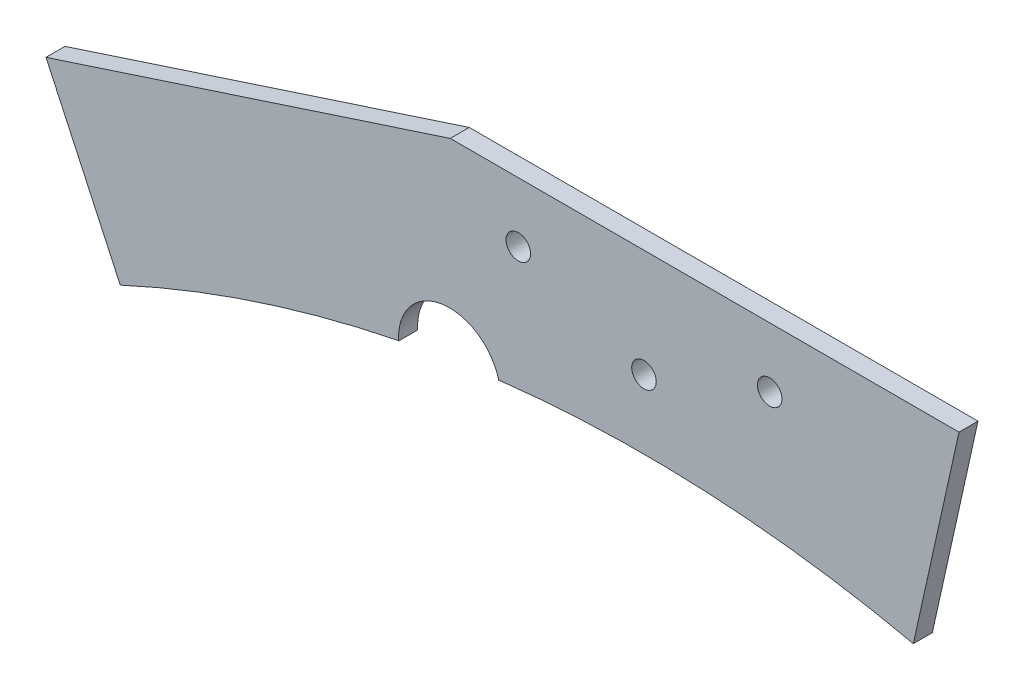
ISO-10303-21;
HEADER;
FILE_DESCRIPTION(('STEP AP214'),'2;1');
FILE_NAME('part.step','',(''),(''),'','','');
FILE_SCHEMA(('AUTOMOTIVE_DESIGN { 1 0 10303 214 1 1 1 1 }'));
ENDSEC;
DATA;
#1=APPLICATION_CONTEXT('core data for automotive mechanical design processes');
#2=APPLICATION_PROTOCOL_DEFINITION('international standard','automotive_design',2000,#1);
#3=PRODUCT_CONTEXT('',#1,'mechanical');
#4=PRODUCT('Part','Part','',(#3));
#5=PRODUCT_RELATED_PRODUCT_CATEGORY('part','',(#4));
#6=PRODUCT_DEFINITION_FORMATION('','',#4);
#7=PRODUCT_DEFINITION_CONTEXT('part definition',#1,'design');
#8=PRODUCT_DEFINITION('design','',#6,#7);
#9=PRODUCT_DEFINITION_SHAPE('','',#8);
#10=(LENGTH_UNIT() NAMED_UNIT(*) SI_UNIT(.MILLI.,.METRE.));
#11=(NAMED_UNIT(*) PLANE_ANGLE_UNIT() SI_UNIT($,.RADIAN.));
#12=(NAMED_UNIT(*) SI_UNIT($,.STERADIAN.) SOLID_ANGLE_UNIT());
#13=UNCERTAINTY_MEASURE_WITH_UNIT(LENGTH_MEASURE(1.E-05),#10,'distance_accuracy_value','');
#14=(GEOMETRIC_REPRESENTATION_CONTEXT(3) GLOBAL_UNCERTAINTY_ASSIGNED_CONTEXT((#13)) GLOBAL_UNIT_ASSIGNED_CONTEXT((#10,
#11,#12)) REPRESENTATION_CONTEXT('',''));
#15=CARTESIAN_POINT('',(0.,0.,0.));
#16=DIRECTION('',(0.,0.,1.));
#17=DIRECTION('',(1.,0.,0.));
#18=AXIS2_PLACEMENT_3D('',#15,#16,#17);
#19=CARTESIAN_POINT('',(0.,0.,6.35));
#20=DIRECTION('',(0.,0.,-1.));
#21=DIRECTION('',(-1.,0.,0.));
#22=AXIS2_PLACEMENT_3D('',#19,#20,#21);
#23=CYLINDRICAL_SURFACE('',#22,416.);
#24=DIRECTION('',(0.,0.,-1.));
#25=VECTOR('',#24,1.);
#26=CARTESIAN_POINT('',(-48.4733196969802,413.166234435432,6.46192739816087));
#27=LINE('',#26,#25);
#28=CARTESIAN_POINT('',(-48.4733196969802,413.166234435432,6.35));
#29=VERTEX_POINT('',#28);
#30=CARTESIAN_POINT('',(-48.4733196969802,413.166234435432,0.));
#31=VERTEX_POINT('',#30);
#32=EDGE_CURVE('E103',#29,#31,#27,.T.);
#33=ORIENTED_EDGE('',*,*,#32,.T.);
#34=CARTESIAN_POINT('',(0.,0.,0.));
#35=DIRECTION('',(0.,0.,-1.));
#36=DIRECTION('',(1.,0.,0.));
#37=AXIS2_PLACEMENT_3D('',#34,#35,#36);
#38=CIRCLE('',#37,416.);
#39=CARTESIAN_POINT('',(89.9999999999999,406.147756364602,0.));
#40=VERTEX_POINT('',#39);
#41=EDGE_CURVE('E145',#31,#40,#38,.T.);
#42=ORIENTED_EDGE('',*,*,#41,.T.);
#43=DIRECTION('',(0.,0.,-1.));
#44=VECTOR('',#43,1.);
#45=CARTESIAN_POINT('',(89.9999999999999,406.147756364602,6.35));
#46=LINE('',#45,#44);
#47=CARTESIAN_POINT('',(89.9999999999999,406.147756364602,6.35));
#48=VERTEX_POINT('',#47);
#49=EDGE_CURVE('E40',#48,#40,#46,.T.);
#50=ORIENTED_EDGE('',*,*,#49,.F.);
#51=CARTESIAN_POINT('',(0.,0.,6.35));
#52=DIRECTION('',(0.,0.,-1.));
#53=DIRECTION('',(1.,0.,0.));
#54=AXIS2_PLACEMENT_3D('',#51,#52,#53);
#55=CIRCLE('',#54,416.);
#56=EDGE_CURVE('E118',#29,#48,#55,.T.);
#57=ORIENTED_EDGE('',*,*,#56,.F.);
#58=EDGE_LOOP('',(#33,#42,#50,#57));
#59=FACE_BOUND('',#58,.T.);
#60=ADVANCED_FACE('F32',(#59),#23,.F.);
#61=DIRECTION('',(0.,0.,-1.));
#62=VECTOR('',#61,1.);
#63=CARTESIAN_POINT('',(-82.0456201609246,407.829028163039,6.46192739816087));
#64=LINE('',#63,#62);
#65=CARTESIAN_POINT('',(-82.0456201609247,407.829028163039,6.35));
#66=VERTEX_POINT('',#65);
#67=CARTESIAN_POINT('',(-82.0456201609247,407.829028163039,0.));
#68=VERTEX_POINT('',#67);
#69=EDGE_CURVE('E47',#66,#68,#64,.T.);
#70=ORIENTED_EDGE('',*,*,#69,.F.);
#71=CARTESIAN_POINT('',(-175.,377.40031796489,6.35));
#72=VERTEX_POINT('',#71);
#73=EDGE_CURVE('E126',#72,#66,#55,.T.);
#74=ORIENTED_EDGE('',*,*,#73,.F.);
#75=DIRECTION('',(0.,0.,-1.));
#76=VECTOR('',#75,1.);
#77=CARTESIAN_POINT('',(-175.,377.40031796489,6.35));
#78=LINE('',#77,#76);
#79=CARTESIAN_POINT('',(-175.,377.40031796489,0.));
#80=VERTEX_POINT('',#79);
#81=EDGE_CURVE('E142',#72,#80,#78,.T.);
#82=ORIENTED_EDGE('',*,*,#81,.T.);
#83=EDGE_CURVE('E52',#80,#68,#38,.T.);
#84=ORIENTED_EDGE('',*,*,#83,.T.);
#85=EDGE_LOOP('',(#70,#74,#82,#84));
#86=FACE_BOUND('',#85,.T.);
#87=ADVANCED_FACE('F34',(#86),#23,.F.);
#88=CARTESIAN_POINT('',(-220.25683615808,475.,6.35));
#89=DIRECTION('',(0.,-1.,0.));
#90=DIRECTION('',(0.,0.,-1.));
#91=AXIS2_PLACEMENT_3D('',#88,#89,#90);
#92=PLANE('',#91);
#93=DIRECTION('',(0.,0.,-1.));
#94=VECTOR('',#93,1.);
#95=CARTESIAN_POINT('',(-64.7427399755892,475.,439.150432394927));
#96=LINE('',#95,#94);
#97=CARTESIAN_POINT('',(-64.742739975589,475.,6.35));
#98=VERTEX_POINT('',#97);
#99=CARTESIAN_POINT('',(-64.742739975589,475.,0.));
#100=VERTEX_POINT('',#99);
#101=EDGE_CURVE('E165',#98,#100,#96,.T.);
#102=ORIENTED_EDGE('',*,*,#101,.F.);
#103=DIRECTION('',(-1.,0.,0.));
#104=VECTOR('',#103,1.);
#105=CARTESIAN_POINT('',(-220.25683615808,475.,6.35));
#106=LINE('',#105,#104);
#107=CARTESIAN_POINT('',(105.257260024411,475.,6.35));
#108=VERTEX_POINT('',#107);
#109=EDGE_CURVE('E137',#108,#98,#106,.T.);
#110=ORIENTED_EDGE('',*,*,#109,.F.);
#111=DIRECTION('',(0.,0.,-1.));
#112=VECTOR('',#111,1.);
#113=CARTESIAN_POINT('',(105.257260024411,475.,6.35));
#114=LINE('',#113,#112);
#115=CARTESIAN_POINT('',(105.257260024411,475.,0.));
#116=VERTEX_POINT('',#115);
#117=EDGE_CURVE('E150',#108,#116,#114,.T.);
#118=ORIENTED_EDGE('',*,*,#117,.T.);
#119=DIRECTION('',(-1.,0.,0.));
#120=VECTOR('',#119,1.);
#121=CARTESIAN_POINT('',(-220.25683615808,475.,0.));
#122=LINE('',#121,#120);
#123=EDGE_CURVE('E130',#116,#100,#122,.T.);
#124=ORIENTED_EDGE('',*,*,#123,.T.);
#125=EDGE_LOOP('',(#102,#110,#118,#124));
#126=FACE_BOUND('',#125,.T.);
#127=ADVANCED_FACE('F218',(#126),#92,.F.);
#128=CARTESIAN_POINT('',(-175.,377.40031796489,6.35));
#129=DIRECTION('',(0.907212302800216,0.420673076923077,0.));
#130=DIRECTION('',(-0.420673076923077,0.907212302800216,0.));
#131=AXIS2_PLACEMENT_3D('',#128,#129,#130);
#132=PLANE('',#131);
#133=DIRECTION('',(0.,0.,-1.));
#134=VECTOR('',#133,1.);
#135=CARTESIAN_POINT('',(-199.819711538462,430.925843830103,439.150432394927));
#136=LINE('',#135,#134);
#137=CARTESIAN_POINT('',(-199.819711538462,430.925843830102,6.35));
#138=VERTEX_POINT('',#137);
#139=CARTESIAN_POINT('',(-199.819711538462,430.925843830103,0.));
#140=VERTEX_POINT('',#139);
#141=EDGE_CURVE('E167',#138,#140,#136,.T.);
#142=ORIENTED_EDGE('',*,*,#141,.T.);
#143=DIRECTION('',(0.420673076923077,-0.907212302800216,0.));
#144=VECTOR('',#143,1.);
#145=CARTESIAN_POINT('',(-175.,377.40031796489,0.));
#146=LINE('',#145,#144);
#147=EDGE_CURVE('E127',#140,#80,#146,.T.);
#148=ORIENTED_EDGE('',*,*,#147,.T.);
#149=ORIENTED_EDGE('',*,*,#81,.F.);
#150=DIRECTION('',(0.420673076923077,-0.907212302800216,0.));
#151=VECTOR('',#150,1.);
#152=CARTESIAN_POINT('',(-175.,377.40031796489,6.35));
#153=LINE('',#152,#151);
#154=EDGE_CURVE('E140',#138,#72,#153,.T.);
#155=ORIENTED_EDGE('',*,*,#154,.F.);
#156=EDGE_LOOP('',(#142,#148,#149,#155));
#157=FACE_BOUND('',#156,.T.);
#158=ADVANCED_FACE('F194',(#157),#132,.F.);
#159=CARTESIAN_POINT('',(0.,0.,6.35));
#160=DIRECTION('',(0.,0.,1.));
#161=DIRECTION('',(1.,0.,0.));
#162=AXIS2_PLACEMENT_3D('',#159,#160,#161);
#163=PLANE('',#162);
#164=CARTESIAN_POINT('',(-64.9999999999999,408.865503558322,6.35));
#165=DIRECTION('',(0.,0.,1.));
#166=DIRECTION('',(1.,0.,0.));
#167=AXIS2_PLACEMENT_3D('',#164,#165,#166);
#168=CIRCLE('',#167,17.);
#169=CARTESIAN_POINT('',(-48.532051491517,413.085298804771,6.35));
#170=VERTEX_POINT('',#169);
#171=CARTESIAN_POINT('',(-81.9646845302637,407.770296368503,6.35));
#172=VERTEX_POINT('',#171);
#173=EDGE_CURVE('E121',#170,#172,#168,.T.);
#174=ORIENTED_EDGE('',*,*,#173,.F.);
#175=DIRECTION('',(0.587317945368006,0.809356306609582,0.));
#176=VECTOR('',#175,1.);
#177=CARTESIAN_POINT('',(-48.532051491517,413.085298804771,6.35));
#178=LINE('',#177,#176);
#179=EDGE_CURVE('E107',#170,#29,#178,.T.);
#180=ORIENTED_EDGE('',*,*,#179,.T.);
#181=ORIENTED_EDGE('',*,*,#56,.T.);
#182=DIRECTION('',(0.216346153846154,0.976316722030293,0.));
#183=VECTOR('',#182,1.);
#184=CARTESIAN_POINT('',(89.9999999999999,406.147756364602,6.35));
#185=LINE('',#184,#183);
#186=EDGE_CURVE('E129',#48,#108,#185,.T.);
#187=ORIENTED_EDGE('',*,*,#186,.T.);
#188=ORIENTED_EDGE('',*,*,#109,.T.);
#189=DIRECTION('',(-0.950673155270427,-0.310194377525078,0.));
#190=VECTOR('',#189,1.);
#191=CARTESIAN_POINT('',(-146.303979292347,448.387448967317,6.35));
#192=LINE('',#191,#190);
#193=EDGE_CURVE('E158',#98,#138,#192,.T.);
#194=ORIENTED_EDGE('',*,*,#193,.T.);
#195=ORIENTED_EDGE('',*,*,#154,.T.);
#196=ORIENTED_EDGE('',*,*,#73,.T.);
#197=DIRECTION('',(0.809356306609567,-0.587317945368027,0.));
#198=VECTOR('',#197,1.);
#199=CARTESIAN_POINT('',(-81.9646845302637,407.770296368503,6.35));
#200=LINE('',#199,#198);
#201=EDGE_CURVE('E248',#66,#172,#200,.T.);
#202=ORIENTED_EDGE('',*,*,#201,.T.);
#203=EDGE_LOOP('',(#174,#180,#181,#187,#188,#194,#195,#196,#202));
#204=FACE_BOUND('',#203,.T.);
#205=CARTESIAN_POINT('',(0.,439.,6.35));
#206=DIRECTION('',(0.,0.,1.));
#207=DIRECTION('',(1.,0.,0.));
#208=AXIS2_PLACEMENT_3D('',#205,#206,#207);
#209=CIRCLE('',#208,4.09999999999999);
#210=CARTESIAN_POINT('',(4.09999999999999,439.,6.35));
#211=VERTEX_POINT('',#210);
#212=EDGE_CURVE('E134',#211,#211,#209,.T.);
#213=ORIENTED_EDGE('',*,*,#212,.F.);
#214=EDGE_LOOP('',(#213));
#215=FACE_BOUND('',#214,.T.);
#216=CARTESIAN_POINT('',(42.,455.,6.35));
#217=DIRECTION('',(0.,0.,1.));
#218=DIRECTION('',(1.,0.,0.));
#219=AXIS2_PLACEMENT_3D('',#216,#217,#218);
#220=CIRCLE('',#219,4.1);
#221=CARTESIAN_POINT('',(46.1,455.,6.35));
#222=VERTEX_POINT('',#221);
#223=EDGE_CURVE('E177',#222,#222,#220,.T.);
#224=ORIENTED_EDGE('',*,*,#223,.F.);
#225=EDGE_LOOP('',(#224));
#226=FACE_BOUND('',#225,.T.);
#227=CARTESIAN_POINT('',(-42.,455.,6.35));
#228=DIRECTION('',(0.,0.,1.));
#229=DIRECTION('',(1.,0.,0.));
#230=AXIS2_PLACEMENT_3D('',#227,#228,#229);
#231=CIRCLE('',#230,4.1);
#232=CARTESIAN_POINT('',(-37.9,455.,6.35));
#233=VERTEX_POINT('',#232);
#234=EDGE_CURVE('E168',#233,#233,#231,.T.);
#235=ORIENTED_EDGE('',*,*,#234,.F.);
#236=EDGE_LOOP('',(#235));
#237=FACE_BOUND('',#236,.T.);
#238=ADVANCED_FACE('F116',(#204,#215,#226,#237),#163,.T.);
#239=CARTESIAN_POINT('',(0.,0.,0.));
#240=DIRECTION('',(0.,0.,1.));
#241=DIRECTION('',(1.,0.,0.));
#242=AXIS2_PLACEMENT_3D('',#239,#240,#241);
#243=PLANE('',#242);
#244=CARTESIAN_POINT('',(0.,439.,0.));
#245=DIRECTION('',(0.,0.,1.));
#246=DIRECTION('',(1.,0.,0.));
#247=AXIS2_PLACEMENT_3D('',#244,#245,#246);
#248=CIRCLE('',#247,4.09999999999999);
#249=CARTESIAN_POINT('',(4.09999999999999,439.,0.));
#250=VERTEX_POINT('',#249);
#251=EDGE_CURVE('E183',#250,#250,#248,.T.);
#252=ORIENTED_EDGE('',*,*,#251,.T.);
#253=EDGE_LOOP('',(#252));
#254=FACE_BOUND('',#253,.T.);
#255=CARTESIAN_POINT('',(42.,455.,0.));
#256=DIRECTION('',(0.,0.,1.));
#257=DIRECTION('',(1.,0.,0.));
#258=AXIS2_PLACEMENT_3D('',#255,#256,#257);
#259=CIRCLE('',#258,4.1);
#260=CARTESIAN_POINT('',(46.1,455.,0.));
#261=VERTEX_POINT('',#260);
#262=EDGE_CURVE('E179',#261,#261,#259,.T.);
#263=ORIENTED_EDGE('',*,*,#262,.T.);
#264=EDGE_LOOP('',(#263));
#265=FACE_BOUND('',#264,.T.);
#266=CARTESIAN_POINT('',(-42.,455.,0.));
#267=DIRECTION('',(0.,0.,1.));
#268=DIRECTION('',(1.,0.,0.));
#269=AXIS2_PLACEMENT_3D('',#266,#267,#268);
#270=CIRCLE('',#269,4.1);
#271=CARTESIAN_POINT('',(-37.9,455.,0.));
#272=VERTEX_POINT('',#271);
#273=EDGE_CURVE('E171',#272,#272,#270,.T.);
#274=ORIENTED_EDGE('',*,*,#273,.T.);
#275=EDGE_LOOP('',(#274));
#276=FACE_BOUND('',#275,.T.);
#277=ORIENTED_EDGE('',*,*,#41,.F.);
#278=DIRECTION('',(0.587317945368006,0.809356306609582,0.));
#279=VECTOR('',#278,1.);
#280=CARTESIAN_POINT('',(-48.532051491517,413.085298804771,0.));
#281=LINE('',#280,#279);
#282=CARTESIAN_POINT('',(-48.532051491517,413.085298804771,0.));
#283=VERTEX_POINT('',#282);
#284=EDGE_CURVE('E110',#283,#31,#281,.T.);
#285=ORIENTED_EDGE('',*,*,#284,.F.);
#286=CARTESIAN_POINT('',(-64.9999999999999,408.865503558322,0.));
#287=DIRECTION('',(0.,0.,1.));
#288=DIRECTION('',(1.,0.,0.));
#289=AXIS2_PLACEMENT_3D('',#286,#287,#288);
#290=CIRCLE('',#289,17.);
#291=CARTESIAN_POINT('',(-81.9646845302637,407.770296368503,0.));
#292=VERTEX_POINT('',#291);
#293=EDGE_CURVE('E245',#283,#292,#290,.T.);
#294=ORIENTED_EDGE('',*,*,#293,.T.);
#295=DIRECTION('',(0.809356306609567,-0.587317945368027,0.));
#296=VECTOR('',#295,1.);
#297=CARTESIAN_POINT('',(-81.9646845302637,407.770296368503,0.));
#298=LINE('',#297,#296);
#299=EDGE_CURVE('E253',#68,#292,#298,.T.);
#300=ORIENTED_EDGE('',*,*,#299,.F.);
#301=ORIENTED_EDGE('',*,*,#83,.F.);
#302=ORIENTED_EDGE('',*,*,#147,.F.);
#303=DIRECTION('',(-0.950673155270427,-0.310194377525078,0.));
#304=VECTOR('',#303,1.);
#305=CARTESIAN_POINT('',(-146.303979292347,448.387448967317,0.));
#306=LINE('',#305,#304);
#307=EDGE_CURVE('E11',#100,#140,#306,.T.);
#308=ORIENTED_EDGE('',*,*,#307,.F.);
#309=ORIENTED_EDGE('',*,*,#123,.F.);
#310=DIRECTION('',(0.216346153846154,0.976316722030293,0.));
#311=VECTOR('',#310,1.);
#312=CARTESIAN_POINT('',(89.9999999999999,406.147756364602,0.));
#313=LINE('',#312,#311);
#314=EDGE_CURVE('E144',#40,#116,#313,.T.);
#315=ORIENTED_EDGE('',*,*,#314,.F.);
#316=EDGE_LOOP('',(#277,#285,#294,#300,#301,#302,#308,#309,#315));
#317=FACE_BOUND('',#316,.T.);
#318=ADVANCED_FACE('F193',(#254,#265,#276,#317),#243,.F.);
#319=CARTESIAN_POINT('',(89.9999999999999,406.147756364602,6.35));
#320=DIRECTION('',(-0.976316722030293,0.216346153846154,0.));
#321=DIRECTION('',(-0.216346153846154,-0.976316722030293,0.));
#322=AXIS2_PLACEMENT_3D('',#319,#320,#321);
#323=PLANE('',#322);
#324=ORIENTED_EDGE('',*,*,#314,.T.);
#325=ORIENTED_EDGE('',*,*,#117,.F.);
#326=ORIENTED_EDGE('',*,*,#186,.F.);
#327=ORIENTED_EDGE('',*,*,#49,.T.);
#328=EDGE_LOOP('',(#324,#325,#326,#327));
#329=FACE_BOUND('',#328,.T.);
#330=ADVANCED_FACE('F153',(#329),#323,.F.);
#331=CARTESIAN_POINT('',(0.,439.,0.));
#332=DIRECTION('',(0.,0.,1.));
#333=DIRECTION('',(1.,0.,0.));
#334=AXIS2_PLACEMENT_3D('',#331,#332,#333);
#335=CYLINDRICAL_SURFACE('',#334,4.09999999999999);
#336=ORIENTED_EDGE('',*,*,#251,.F.);
#337=EDGE_LOOP('',(#336));
#338=FACE_BOUND('',#337,.T.);
#339=ORIENTED_EDGE('',*,*,#212,.T.);
#340=EDGE_LOOP('',(#339));
#341=FACE_BOUND('',#340,.T.);
#342=ADVANCED_FACE('F190',(#338,#341),#335,.F.);
#343=CARTESIAN_POINT('',(42.,455.,0.));
#344=DIRECTION('',(0.,0.,1.));
#345=DIRECTION('',(1.,0.,0.));
#346=AXIS2_PLACEMENT_3D('',#343,#344,#345);
#347=CYLINDRICAL_SURFACE('',#346,4.1);
#348=ORIENTED_EDGE('',*,*,#262,.F.);
#349=EDGE_LOOP('',(#348));
#350=FACE_BOUND('',#349,.T.);
#351=ORIENTED_EDGE('',*,*,#223,.T.);
#352=EDGE_LOOP('',(#351));
#353=FACE_BOUND('',#352,.T.);
#354=ADVANCED_FACE('F202',(#350,#353),#347,.F.);
#355=CARTESIAN_POINT('',(-42.,455.,0.));
#356=DIRECTION('',(0.,0.,1.));
#357=DIRECTION('',(1.,0.,0.));
#358=AXIS2_PLACEMENT_3D('',#355,#356,#357);
#359=CYLINDRICAL_SURFACE('',#358,4.1);
#360=ORIENTED_EDGE('',*,*,#273,.F.);
#361=EDGE_LOOP('',(#360));
#362=FACE_BOUND('',#361,.T.);
#363=ORIENTED_EDGE('',*,*,#234,.T.);
#364=EDGE_LOOP('',(#363));
#365=FACE_BOUND('',#364,.T.);
#366=ADVANCED_FACE('F200',(#362,#365),#359,.F.);
#367=CARTESIAN_POINT('',(-199.819711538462,430.925843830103,439.150432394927));
#368=DIRECTION('',(-0.310194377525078,0.950673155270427,0.));
#369=DIRECTION('',(-0.950673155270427,-0.310194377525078,0.));
#370=AXIS2_PLACEMENT_3D('',#367,#368,#369);
#371=PLANE('',#370);
#372=ORIENTED_EDGE('',*,*,#193,.F.);
#373=ORIENTED_EDGE('',*,*,#101,.T.);
#374=ORIENTED_EDGE('',*,*,#307,.T.);
#375=ORIENTED_EDGE('',*,*,#141,.F.);
#376=EDGE_LOOP('',(#372,#373,#374,#375));
#377=FACE_BOUND('',#376,.T.);
#378=ADVANCED_FACE('F164',(#377),#371,.T.);
#379=CARTESIAN_POINT('',(-64.9999999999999,408.865503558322,0.));
#380=DIRECTION('',(0.,0.,1.));
#381=DIRECTION('',(1.,0.,0.));
#382=AXIS2_PLACEMENT_3D('',#379,#380,#381);
#383=CYLINDRICAL_SURFACE('',#382,17.);
#384=ORIENTED_EDGE('',*,*,#173,.T.);
#385=DIRECTION('',(0.,0.,-1.));
#386=VECTOR('',#385,1.);
#387=CARTESIAN_POINT('',(-81.9646845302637,407.770296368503,6.46192739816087));
#388=LINE('',#387,#386);
#389=EDGE_CURVE('E122',#172,#292,#388,.T.);
#390=ORIENTED_EDGE('',*,*,#389,.T.);
#391=ORIENTED_EDGE('',*,*,#293,.F.);
#392=DIRECTION('',(0.,0.,-1.));
#393=VECTOR('',#392,1.);
#394=CARTESIAN_POINT('',(-48.532051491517,413.085298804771,6.46192739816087));
#395=LINE('',#394,#393);
#396=EDGE_CURVE('E257',#170,#283,#395,.T.);
#397=ORIENTED_EDGE('',*,*,#396,.F.);
#398=EDGE_LOOP('',(#384,#390,#391,#397));
#399=FACE_BOUND('',#398,.T.);
#400=ADVANCED_FACE('F209',(#399),#383,.F.);
#401=CARTESIAN_POINT('',(-81.9646845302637,407.770296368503,6.46192739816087));
#402=DIRECTION('',(0.587317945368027,0.809356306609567,0.));
#403=DIRECTION('',(-0.809356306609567,0.587317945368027,0.));
#404=AXIS2_PLACEMENT_3D('',#401,#402,#403);
#405=PLANE('',#404);
#406=ORIENTED_EDGE('',*,*,#201,.F.);
#407=ORIENTED_EDGE('',*,*,#69,.T.);
#408=ORIENTED_EDGE('',*,*,#299,.T.);
#409=ORIENTED_EDGE('',*,*,#389,.F.);
#410=EDGE_LOOP('',(#406,#407,#408,#409));
#411=FACE_BOUND('',#410,.T.);
#412=ADVANCED_FACE('F263',(#411),#405,.F.);
#413=CARTESIAN_POINT('',(-48.532051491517,413.085298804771,6.46192739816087));
#414=DIRECTION('',(-0.809356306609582,0.587317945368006,0.));
#415=DIRECTION('',(-0.587317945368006,-0.809356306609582,0.));
#416=AXIS2_PLACEMENT_3D('',#413,#414,#415);
#417=PLANE('',#416);
#418=ORIENTED_EDGE('',*,*,#179,.F.);
#419=ORIENTED_EDGE('',*,*,#396,.T.);
#420=ORIENTED_EDGE('',*,*,#284,.T.);
#421=ORIENTED_EDGE('',*,*,#32,.F.);
#422=EDGE_LOOP('',(#418,#419,#420,#421));
#423=FACE_BOUND('',#422,.T.);
#424=ADVANCED_FACE('F105',(#423),#417,.F.);
#425=CLOSED_SHELL('',(#60,#87,#127,#158,#238,#318,#330,#342,#354,#366,#378,#400,#412,#424));
#426=MANIFOLD_SOLID_BREP('B2',#425);
#427=ADVANCED_BREP_SHAPE_REPRESENTATION('',(#18,#426),#14);
#428=SHAPE_DEFINITION_REPRESENTATION(#9,#427);
ENDSEC;
END-ISO-10303-21;
